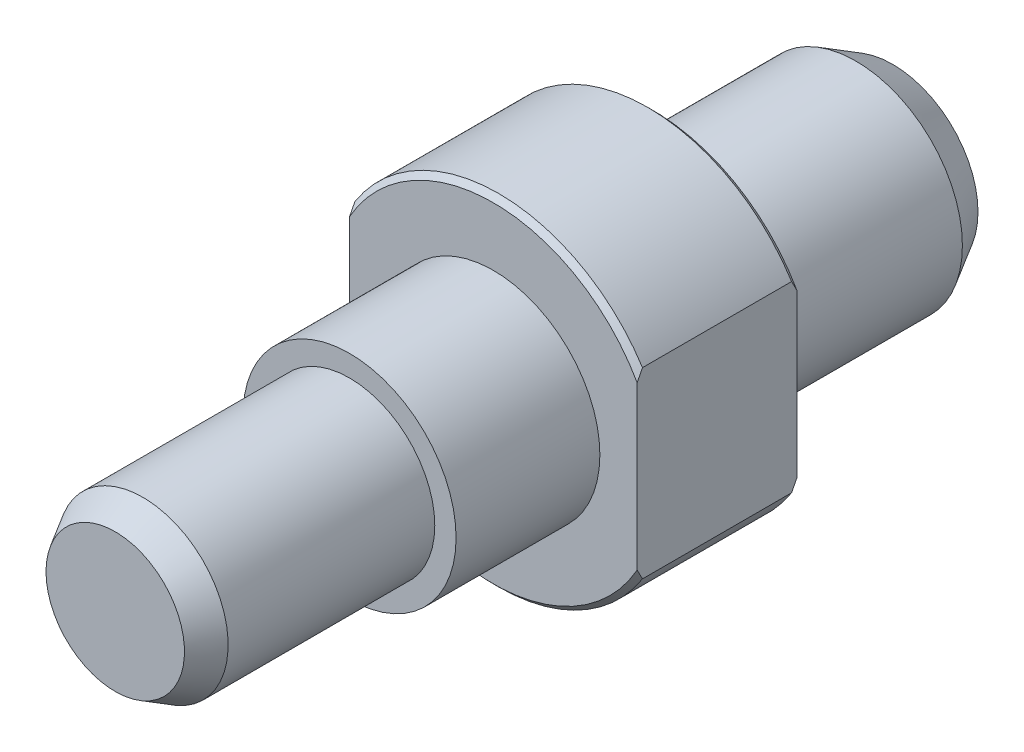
ISO-10303-21;
HEADER;
FILE_DESCRIPTION(('STEP AP214'),'2;1');
FILE_NAME('part.step','',(''),(''),'','','');
FILE_SCHEMA(('AUTOMOTIVE_DESIGN { 1 0 10303 214 1 1 1 1 }'));
ENDSEC;
DATA;
#1=APPLICATION_CONTEXT('core data for automotive mechanical design processes');
#2=APPLICATION_PROTOCOL_DEFINITION('international standard','automotive_design',2000,#1);
#3=PRODUCT_CONTEXT('',#1,'mechanical');
#4=PRODUCT('Part','Part','',(#3));
#5=PRODUCT_RELATED_PRODUCT_CATEGORY('part','',(#4));
#6=PRODUCT_DEFINITION_FORMATION('','',#4);
#7=PRODUCT_DEFINITION_CONTEXT('part definition',#1,'design');
#8=PRODUCT_DEFINITION('design','',#6,#7);
#9=PRODUCT_DEFINITION_SHAPE('','',#8);
#10=(LENGTH_UNIT() NAMED_UNIT(*) SI_UNIT(.MILLI.,.METRE.));
#11=(NAMED_UNIT(*) PLANE_ANGLE_UNIT() SI_UNIT($,.RADIAN.));
#12=(NAMED_UNIT(*) SI_UNIT($,.STERADIAN.) SOLID_ANGLE_UNIT());
#13=UNCERTAINTY_MEASURE_WITH_UNIT(LENGTH_MEASURE(1.E-05),#10,'distance_accuracy_value','');
#14=(GEOMETRIC_REPRESENTATION_CONTEXT(3) GLOBAL_UNCERTAINTY_ASSIGNED_CONTEXT((#13)) GLOBAL_UNIT_ASSIGNED_CONTEXT((#10,
#11,#12)) REPRESENTATION_CONTEXT('',''));
#15=CARTESIAN_POINT('',(0.,0.,0.));
#16=DIRECTION('',(0.,0.,1.));
#17=DIRECTION('',(1.,0.,0.));
#18=AXIS2_PLACEMENT_3D('',#15,#16,#17);
#19=CARTESIAN_POINT('',(0.,0.,0.));
#20=DIRECTION('',(0.,0.,1.));
#21=DIRECTION('',(1.,0.,0.));
#22=AXIS2_PLACEMENT_3D('',#19,#20,#21);
#23=PLANE('',#22);
#24=CARTESIAN_POINT('',(0.,0.,0.));
#25=DIRECTION('',(0.,0.,1.));
#26=DIRECTION('',(1.,0.,0.));
#27=AXIS2_PLACEMENT_3D('',#24,#25,#26);
#28=CIRCLE('',#27,10.);
#29=CARTESIAN_POINT('',(10.,0.,0.));
#30=VERTEX_POINT('',#29);
#31=EDGE_CURVE('E204',#30,#30,#28,.T.);
#32=ORIENTED_EDGE('',*,*,#31,.T.);
#33=EDGE_LOOP('',(#32));
#34=FACE_BOUND('',#33,.T.);
#35=DIRECTION('',(0.,1.,0.));
#36=VECTOR('',#35,1.);
#37=CARTESIAN_POINT('',(13.5,0.,0.));
#38=LINE('',#37,#36);
#39=CARTESIAN_POINT('',(13.5,-7.61577310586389,0.));
#40=VERTEX_POINT('',#39);
#41=CARTESIAN_POINT('',(13.5,7.6157731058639,0.));
#42=VERTEX_POINT('',#41);
#43=EDGE_CURVE('E211',#40,#42,#38,.T.);
#44=ORIENTED_EDGE('',*,*,#43,.F.);
#45=CARTESIAN_POINT('',(0.,0.,0.));
#46=DIRECTION('',(0.,0.,1.));
#47=DIRECTION('',(1.,0.,0.));
#48=AXIS2_PLACEMENT_3D('',#45,#46,#47);
#49=CIRCLE('',#48,15.5);
#50=CARTESIAN_POINT('',(-13.5,-7.6157731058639,0.));
#51=VERTEX_POINT('',#50);
#52=EDGE_CURVE('E401',#40,#51,#49,.F.);
#53=ORIENTED_EDGE('',*,*,#52,.T.);
#54=DIRECTION('',(0.,-1.,0.));
#55=VECTOR('',#54,1.);
#56=CARTESIAN_POINT('',(-13.5,0.,0.));
#57=LINE('',#56,#55);
#58=CARTESIAN_POINT('',(-13.5,7.61577310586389,0.));
#59=VERTEX_POINT('',#58);
#60=EDGE_CURVE('E87',#59,#51,#57,.T.);
#61=ORIENTED_EDGE('',*,*,#60,.F.);
#62=CARTESIAN_POINT('',(0.,0.,0.));
#63=DIRECTION('',(0.,0.,1.));
#64=DIRECTION('',(1.,0.,0.));
#65=AXIS2_PLACEMENT_3D('',#62,#63,#64);
#66=CIRCLE('',#65,15.5);
#67=EDGE_CURVE('E399',#59,#42,#66,.F.);
#68=ORIENTED_EDGE('',*,*,#67,.T.);
#69=EDGE_LOOP('',(#44,#53,#61,#68));
#70=FACE_BOUND('',#69,.T.);
#71=ADVANCED_FACE('F14',(#34,#70),#23,.F.);
#72=CARTESIAN_POINT('',(0.,0.,15.));
#73=DIRECTION('',(0.,0.,-1.));
#74=DIRECTION('',(-1.,0.,0.));
#75=AXIS2_PLACEMENT_3D('',#72,#73,#74);
#76=CYLINDRICAL_SURFACE('',#75,16.);
#77=DIRECTION('',(0.,0.,-1.));
#78=VECTOR('',#77,1.);
#79=CARTESIAN_POINT('',(13.5,8.58778201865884,15.));
#80=LINE('',#79,#78);
#81=CARTESIAN_POINT('',(13.5,8.58778201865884,0.5));
#82=VERTEX_POINT('',#81);
#83=CARTESIAN_POINT('',(13.5,8.58778201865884,14.5));
#84=VERTEX_POINT('',#83);
#85=EDGE_CURVE('E186',#82,#84,#80,.F.);
#86=ORIENTED_EDGE('',*,*,#85,.F.);
#87=CARTESIAN_POINT('',(0.,0.,0.5));
#88=DIRECTION('',(0.,0.,1.));
#89=DIRECTION('',(1.,0.,0.));
#90=AXIS2_PLACEMENT_3D('',#87,#88,#89);
#91=CIRCLE('',#90,16.);
#92=CARTESIAN_POINT('',(-13.5,8.58778201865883,0.5));
#93=VERTEX_POINT('',#92);
#94=EDGE_CURVE('E9',#82,#93,#91,.T.);
#95=ORIENTED_EDGE('',*,*,#94,.T.);
#96=DIRECTION('',(0.,0.,-1.));
#97=VECTOR('',#96,1.);
#98=CARTESIAN_POINT('',(-13.5,8.58778201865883,15.));
#99=LINE('',#98,#97);
#100=CARTESIAN_POINT('',(-13.5,8.58778201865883,14.5));
#101=VERTEX_POINT('',#100);
#102=EDGE_CURVE('E102',#101,#93,#99,.T.);
#103=ORIENTED_EDGE('',*,*,#102,.F.);
#104=CARTESIAN_POINT('',(0.,0.,14.5));
#105=DIRECTION('',(0.,0.,1.));
#106=DIRECTION('',(1.,0.,0.));
#107=AXIS2_PLACEMENT_3D('',#104,#105,#106);
#108=CIRCLE('',#107,16.);
#109=EDGE_CURVE('E23',#101,#84,#108,.F.);
#110=ORIENTED_EDGE('',*,*,#109,.T.);
#111=EDGE_LOOP('',(#86,#95,#103,#110));
#112=FACE_BOUND('',#111,.T.);
#113=ADVANCED_FACE('F185',(#112),#76,.T.);
#114=DIRECTION('',(0.,0.,-1.));
#115=VECTOR('',#114,1.);
#116=CARTESIAN_POINT('',(-13.5,-8.58778201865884,15.));
#117=LINE('',#116,#115);
#118=CARTESIAN_POINT('',(-13.5,-8.58778201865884,0.5));
#119=VERTEX_POINT('',#118);
#120=CARTESIAN_POINT('',(-13.5,-8.58778201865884,14.5));
#121=VERTEX_POINT('',#120);
#122=EDGE_CURVE('E84',#119,#121,#117,.F.);
#123=ORIENTED_EDGE('',*,*,#122,.F.);
#124=CARTESIAN_POINT('',(0.,0.,0.5));
#125=DIRECTION('',(0.,0.,1.));
#126=DIRECTION('',(1.,0.,0.));
#127=AXIS2_PLACEMENT_3D('',#124,#125,#126);
#128=CIRCLE('',#127,16.);
#129=CARTESIAN_POINT('',(13.5,-8.58778201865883,0.5));
#130=VERTEX_POINT('',#129);
#131=EDGE_CURVE('E98',#119,#130,#128,.T.);
#132=ORIENTED_EDGE('',*,*,#131,.T.);
#133=DIRECTION('',(0.,0.,-1.));
#134=VECTOR('',#133,1.);
#135=CARTESIAN_POINT('',(13.5,-8.58778201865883,15.));
#136=LINE('',#135,#134);
#137=CARTESIAN_POINT('',(13.5,-8.58778201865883,14.5));
#138=VERTEX_POINT('',#137);
#139=EDGE_CURVE('E193',#138,#130,#136,.T.);
#140=ORIENTED_EDGE('',*,*,#139,.F.);
#141=CARTESIAN_POINT('',(0.,0.,14.5));
#142=DIRECTION('',(0.,0.,1.));
#143=DIRECTION('',(1.,0.,0.));
#144=AXIS2_PLACEMENT_3D('',#141,#142,#143);
#145=CIRCLE('',#144,16.);
#146=EDGE_CURVE('E101',#138,#121,#145,.F.);
#147=ORIENTED_EDGE('',*,*,#146,.T.);
#148=EDGE_LOOP('',(#123,#132,#140,#147));
#149=FACE_BOUND('',#148,.T.);
#150=ADVANCED_FACE('F96',(#149),#76,.T.);
#151=CARTESIAN_POINT('',(0.,0.,15.));
#152=DIRECTION('',(0.,0.,1.));
#153=DIRECTION('',(1.,0.,0.));
#154=AXIS2_PLACEMENT_3D('',#151,#152,#153);
#155=PLANE('',#154);
#156=CARTESIAN_POINT('',(0.,0.,15.));
#157=DIRECTION('',(0.,0.,1.));
#158=DIRECTION('',(1.,0.,0.));
#159=AXIS2_PLACEMENT_3D('',#156,#157,#158);
#160=CIRCLE('',#159,10.);
#161=CARTESIAN_POINT('',(10.,0.,15.));
#162=VERTEX_POINT('',#161);
#163=EDGE_CURVE('E207',#162,#162,#160,.T.);
#164=ORIENTED_EDGE('',*,*,#163,.F.);
#165=EDGE_LOOP('',(#164));
#166=FACE_BOUND('',#165,.T.);
#167=DIRECTION('',(0.,-1.,0.));
#168=VECTOR('',#167,1.);
#169=CARTESIAN_POINT('',(-13.5,0.,15.));
#170=LINE('',#169,#168);
#171=CARTESIAN_POINT('',(-13.5,7.61577310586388,15.));
#172=VERTEX_POINT('',#171);
#173=CARTESIAN_POINT('',(-13.5,-7.61577310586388,15.));
#174=VERTEX_POINT('',#173);
#175=EDGE_CURVE('E111',#172,#174,#170,.T.);
#176=ORIENTED_EDGE('',*,*,#175,.T.);
#177=CARTESIAN_POINT('',(0.,0.,15.));
#178=DIRECTION('',(0.,0.,1.));
#179=DIRECTION('',(1.,0.,0.));
#180=AXIS2_PLACEMENT_3D('',#177,#178,#179);
#181=CIRCLE('',#180,15.5);
#182=CARTESIAN_POINT('',(13.5,-7.61577310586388,15.));
#183=VERTEX_POINT('',#182);
#184=EDGE_CURVE('E179',#174,#183,#181,.T.);
#185=ORIENTED_EDGE('',*,*,#184,.T.);
#186=DIRECTION('',(0.,1.,0.));
#187=VECTOR('',#186,1.);
#188=CARTESIAN_POINT('',(13.5,0.,15.));
#189=LINE('',#188,#187);
#190=CARTESIAN_POINT('',(13.5,7.61577310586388,15.));
#191=VERTEX_POINT('',#190);
#192=EDGE_CURVE('E200',#183,#191,#189,.T.);
#193=ORIENTED_EDGE('',*,*,#192,.T.);
#194=CARTESIAN_POINT('',(0.,0.,15.));
#195=DIRECTION('',(0.,0.,1.));
#196=DIRECTION('',(1.,0.,0.));
#197=AXIS2_PLACEMENT_3D('',#194,#195,#196);
#198=CIRCLE('',#197,15.5);
#199=EDGE_CURVE('E91',#191,#172,#198,.T.);
#200=ORIENTED_EDGE('',*,*,#199,.T.);
#201=EDGE_LOOP('',(#176,#185,#193,#200));
#202=FACE_BOUND('',#201,.T.);
#203=ADVANCED_FACE('F198',(#166,#202),#155,.T.);
#204=CARTESIAN_POINT('',(0.,0.,0.));
#205=DIRECTION('',(0.,0.,-1.));
#206=DIRECTION('',(-1.,0.,0.));
#207=AXIS2_PLACEMENT_3D('',#204,#205,#206);
#208=CYLINDRICAL_SURFACE('',#207,10.);
#209=CARTESIAN_POINT('',(0.,0.,-19.0358983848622));
#210=DIRECTION('',(0.,0.,1.));
#211=DIRECTION('',(1.,0.,0.));
#212=AXIS2_PLACEMENT_3D('',#209,#210,#211);
#213=CIRCLE('',#212,10.);
#214=CARTESIAN_POINT('',(10.,0.,-19.0358983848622));
#215=VERTEX_POINT('',#214);
#216=EDGE_CURVE('E103',#215,#215,#213,.T.);
#217=ORIENTED_EDGE('',*,*,#216,.T.);
#218=EDGE_LOOP('',(#217));
#219=FACE_BOUND('',#218,.T.);
#220=ORIENTED_EDGE('',*,*,#31,.F.);
#221=EDGE_LOOP('',(#220));
#222=FACE_BOUND('',#221,.T.);
#223=ADVANCED_FACE('F257',(#219,#222),#208,.T.);
#224=CARTESIAN_POINT('',(0.,0.,28.5));
#225=DIRECTION('',(0.,0.,-1.));
#226=DIRECTION('',(-1.,0.,0.));
#227=AXIS2_PLACEMENT_3D('',#224,#225,#226);
#228=CYLINDRICAL_SURFACE('',#227,10.);
#229=CARTESIAN_POINT('',(0.,0.,28.5));
#230=DIRECTION('',(0.,0.,1.));
#231=DIRECTION('',(1.,0.,0.));
#232=AXIS2_PLACEMENT_3D('',#229,#230,#231);
#233=CIRCLE('',#232,10.);
#234=CARTESIAN_POINT('',(10.,0.,28.5));
#235=VERTEX_POINT('',#234);
#236=EDGE_CURVE('E208',#235,#235,#233,.T.);
#237=ORIENTED_EDGE('',*,*,#236,.F.);
#238=EDGE_LOOP('',(#237));
#239=FACE_BOUND('',#238,.T.);
#240=ORIENTED_EDGE('',*,*,#163,.T.);
#241=EDGE_LOOP('',(#240));
#242=FACE_BOUND('',#241,.T.);
#243=ADVANCED_FACE('F254',(#239,#242),#228,.T.);
#244=CARTESIAN_POINT('',(0.,0.,28.5));
#245=DIRECTION('',(0.,0.,1.));
#246=DIRECTION('',(1.,0.,0.));
#247=AXIS2_PLACEMENT_3D('',#244,#245,#246);
#248=PLANE('',#247);
#249=CARTESIAN_POINT('',(0.,0.,28.5));
#250=DIRECTION('',(0.,0.,1.));
#251=DIRECTION('',(1.,0.,0.));
#252=AXIS2_PLACEMENT_3D('',#249,#250,#251);
#253=CIRCLE('',#252,8.);
#254=CARTESIAN_POINT('',(8.,0.,28.5));
#255=VERTEX_POINT('',#254);
#256=EDGE_CURVE('E201',#255,#255,#253,.T.);
#257=ORIENTED_EDGE('',*,*,#256,.F.);
#258=EDGE_LOOP('',(#257));
#259=FACE_BOUND('',#258,.T.);
#260=ORIENTED_EDGE('',*,*,#236,.T.);
#261=EDGE_LOOP('',(#260));
#262=FACE_BOUND('',#261,.T.);
#263=ADVANCED_FACE('F265',(#259,#262),#248,.T.);
#264=CARTESIAN_POINT('',(0.,0.,50.5));
#265=DIRECTION('',(0.,0.,-1.));
#266=DIRECTION('',(-1.,0.,0.));
#267=AXIS2_PLACEMENT_3D('',#264,#265,#266);
#268=CYLINDRICAL_SURFACE('',#267,8.);
#269=CARTESIAN_POINT('',(0.,0.,47.9019237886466));
#270=DIRECTION('',(0.,0.,-1.));
#271=DIRECTION('',(-1.,0.,0.));
#272=AXIS2_PLACEMENT_3D('',#269,#270,#271);
#273=CIRCLE('',#272,8.);
#274=CARTESIAN_POINT('',(-8.,0.,47.9019237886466));
#275=VERTEX_POINT('',#274);
#276=EDGE_CURVE('E225',#275,#275,#273,.T.);
#277=ORIENTED_EDGE('',*,*,#276,.T.);
#278=EDGE_LOOP('',(#277));
#279=FACE_BOUND('',#278,.T.);
#280=ORIENTED_EDGE('',*,*,#256,.T.);
#281=EDGE_LOOP('',(#280));
#282=FACE_BOUND('',#281,.T.);
#283=ADVANCED_FACE('F130',(#279,#282),#268,.T.);
#284=CARTESIAN_POINT('',(13.5,16.5671544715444,50.5));
#285=DIRECTION('',(1.,0.,0.));
#286=DIRECTION('',(0.,1.,0.));
#287=AXIS2_PLACEMENT_3D('',#284,#285,#286);
#288=PLANE('',#287);
#289=ORIENTED_EDGE('',*,*,#139,.T.);
#290=CARTESIAN_POINT('',(13.5,-8.58778201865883,0.5));
#291=CARTESIAN_POINT('',(13.5,-8.50751562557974,0.456918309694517));
#292=CARTESIAN_POINT('',(13.5,-8.42706999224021,0.414170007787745));
#293=CARTESIAN_POINT('',(13.5,-8.26581899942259,0.3293733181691));
#294=CARTESIAN_POINT('',(13.5,-8.18501366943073,0.287324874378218));
#295=CARTESIAN_POINT('',(13.5,-8.0230287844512,0.203953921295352));
#296=CARTESIAN_POINT('',(13.5,-7.94184922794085,0.162631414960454));
#297=CARTESIAN_POINT('',(13.5,-7.77910228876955,0.0807409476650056));
#298=CARTESIAN_POINT('',(13.5,-7.69753487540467,0.0401730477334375));
#299=CARTESIAN_POINT('',(13.5,-7.6157731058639,0.));
#300=B_SPLINE_CURVE_WITH_KNOTS('',3,(#290,#291,#292,#293,#294,#295,#296,#297,#298,#299),
.UNSPECIFIED.,.F.,.F.,(4,2,2,2,4),(0.,0.273291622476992,0.546561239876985,0.81983197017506,
1.09312470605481),.UNSPECIFIED.);
#301=EDGE_CURVE('E106',#130,#40,#300,.T.);
#302=ORIENTED_EDGE('',*,*,#301,.T.);
#303=ORIENTED_EDGE('',*,*,#43,.T.);
#304=CARTESIAN_POINT('',(13.5,7.6157731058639,0.));
#305=CARTESIAN_POINT('',(13.5,7.69753487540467,0.0401730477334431));
#306=CARTESIAN_POINT('',(13.5,7.77910228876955,0.0807409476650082));
#307=CARTESIAN_POINT('',(13.5,7.94184922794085,0.162631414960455));
#308=CARTESIAN_POINT('',(13.5,8.02302878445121,0.203953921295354));
#309=CARTESIAN_POINT('',(13.5,8.18501366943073,0.28732487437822));
#310=CARTESIAN_POINT('',(13.5,8.26581899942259,0.329373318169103));
#311=CARTESIAN_POINT('',(13.5,8.42706999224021,0.414170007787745));
#312=CARTESIAN_POINT('',(13.5,8.50751562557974,0.456918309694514));
#313=CARTESIAN_POINT('',(13.5,8.58778201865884,0.49999999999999));
#314=B_SPLINE_CURVE_WITH_KNOTS('',3,(#304,#305,#306,#307,#308,#309,#310,#311,#312,#313),
.UNSPECIFIED.,.F.,.F.,(4,2,2,2,4),(0.,0.273292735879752,0.546563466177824,0.819833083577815,
1.09312470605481),.UNSPECIFIED.);
#315=EDGE_CURVE('E109',#42,#82,#314,.T.);
#316=ORIENTED_EDGE('',*,*,#315,.T.);
#317=ORIENTED_EDGE('',*,*,#85,.T.);
#318=CARTESIAN_POINT('',(13.5,8.58778201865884,14.5));
#319=CARTESIAN_POINT('',(13.5,8.50751562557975,14.5430816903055));
#320=CARTESIAN_POINT('',(13.5,8.42706999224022,14.5858299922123));
#321=CARTESIAN_POINT('',(13.5,8.2658189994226,14.6706266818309));
#322=CARTESIAN_POINT('',(13.5,8.18501366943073,14.7126751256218));
#323=CARTESIAN_POINT('',(13.5,8.02302878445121,14.7960460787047));
#324=CARTESIAN_POINT('',(13.5,7.94184922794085,14.8373685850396));
#325=CARTESIAN_POINT('',(13.5,7.77910228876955,14.919259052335));
#326=CARTESIAN_POINT('',(13.5,7.69753487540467,14.9598269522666));
#327=CARTESIAN_POINT('',(13.5,7.61577310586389,15.));
#328=B_SPLINE_CURVE_WITH_KNOTS('',3,(#318,#319,#320,#321,#322,#323,#324,#325,#326,#327),
.UNSPECIFIED.,.F.,.F.,(4,2,2,2,4),(0.,0.273291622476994,0.54656123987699,0.819831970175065,
1.09312470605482),.UNSPECIFIED.);
#329=EDGE_CURVE('E107',#84,#191,#328,.T.);
#330=ORIENTED_EDGE('',*,*,#329,.T.);
#331=ORIENTED_EDGE('',*,*,#192,.F.);
#332=CARTESIAN_POINT('',(13.5,-7.61577310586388,15.));
#333=CARTESIAN_POINT('',(13.5,-7.69753487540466,14.9598269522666));
#334=CARTESIAN_POINT('',(13.5,-7.77910228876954,14.919259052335));
#335=CARTESIAN_POINT('',(13.5,-7.94184922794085,14.8373685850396));
#336=CARTESIAN_POINT('',(13.5,-8.02302878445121,14.7960460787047));
#337=CARTESIAN_POINT('',(13.5,-8.18501366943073,14.7126751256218));
#338=CARTESIAN_POINT('',(13.5,-8.2658189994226,14.6706266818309));
#339=CARTESIAN_POINT('',(13.5,-8.42706999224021,14.5858299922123));
#340=CARTESIAN_POINT('',(13.5,-8.50751562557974,14.5430816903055));
#341=CARTESIAN_POINT('',(13.5,-8.58778201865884,14.5));
#342=B_SPLINE_CURVE_WITH_KNOTS('',3,(#332,#333,#334,#335,#336,#337,#338,#339,#340,#341),
.UNSPECIFIED.,.F.,.F.,(4,2,2,2,4),(0.,0.273292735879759,0.546563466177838,0.819833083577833,
1.09312470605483),.UNSPECIFIED.);
#343=EDGE_CURVE('E140',#183,#138,#342,.T.);
#344=ORIENTED_EDGE('',*,*,#343,.T.);
#345=EDGE_LOOP('',(#289,#302,#303,#316,#317,#330,#331,#344));
#346=FACE_BOUND('',#345,.T.);
#347=ADVANCED_FACE('F125',(#346),#288,.T.);
#348=CARTESIAN_POINT('',(-13.5,16.5671544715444,50.5));
#349=DIRECTION('',(-1.,0.,0.));
#350=DIRECTION('',(0.,-1.,0.));
#351=AXIS2_PLACEMENT_3D('',#348,#349,#350);
#352=PLANE('',#351);
#353=ORIENTED_EDGE('',*,*,#60,.T.);
#354=CARTESIAN_POINT('',(-13.5,-7.6157731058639,0.));
#355=CARTESIAN_POINT('',(-13.5,-7.69753487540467,0.0401730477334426));
#356=CARTESIAN_POINT('',(-13.5,-7.77910228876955,0.0807409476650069));
#357=CARTESIAN_POINT('',(-13.5,-7.94184922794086,0.162631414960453));
#358=CARTESIAN_POINT('',(-13.5,-8.02302878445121,0.203953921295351));
#359=CARTESIAN_POINT('',(-13.5,-8.18501366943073,0.287324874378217));
#360=CARTESIAN_POINT('',(-13.5,-8.2658189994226,0.329373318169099));
#361=CARTESIAN_POINT('',(-13.5,-8.42706999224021,0.414170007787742));
#362=CARTESIAN_POINT('',(-13.5,-8.50751562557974,0.456918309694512));
#363=CARTESIAN_POINT('',(-13.5,-8.58778201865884,0.49999999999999));
#364=B_SPLINE_CURVE_WITH_KNOTS('',3,(#354,#355,#356,#357,#358,#359,#360,#361,#362,#363),
.UNSPECIFIED.,.F.,.F.,(4,2,2,2,4),(0.,0.273292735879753,0.546563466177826,0.819833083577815,
1.09312470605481),.UNSPECIFIED.);
#365=EDGE_CURVE('E81',#51,#119,#364,.T.);
#366=ORIENTED_EDGE('',*,*,#365,.T.);
#367=ORIENTED_EDGE('',*,*,#122,.T.);
#368=CARTESIAN_POINT('',(-13.5,-8.58778201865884,14.5));
#369=CARTESIAN_POINT('',(-13.5,-8.50751562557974,14.5430816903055));
#370=CARTESIAN_POINT('',(-13.5,-8.42706999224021,14.5858299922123));
#371=CARTESIAN_POINT('',(-13.5,-8.2658189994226,14.6706266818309));
#372=CARTESIAN_POINT('',(-13.5,-8.18501366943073,14.7126751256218));
#373=CARTESIAN_POINT('',(-13.5,-8.02302878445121,14.7960460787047));
#374=CARTESIAN_POINT('',(-13.5,-7.94184922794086,14.8373685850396));
#375=CARTESIAN_POINT('',(-13.5,-7.77910228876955,14.919259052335));
#376=CARTESIAN_POINT('',(-13.5,-7.69753487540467,14.9598269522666));
#377=CARTESIAN_POINT('',(-13.5,-7.61577310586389,15.));
#378=B_SPLINE_CURVE_WITH_KNOTS('',3,(#368,#369,#370,#371,#372,#373,#374,#375,#376,#377),
.UNSPECIFIED.,.F.,.F.,(4,2,2,2,4),(0.,0.273291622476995,0.54656123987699,0.819831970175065,
1.09312470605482),.UNSPECIFIED.);
#379=EDGE_CURVE('E92',#121,#174,#378,.T.);
#380=ORIENTED_EDGE('',*,*,#379,.T.);
#381=ORIENTED_EDGE('',*,*,#175,.F.);
#382=CARTESIAN_POINT('',(-13.5,7.61577310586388,15.));
#383=CARTESIAN_POINT('',(-13.5,7.69753487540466,14.9598269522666));
#384=CARTESIAN_POINT('',(-13.5,7.77910228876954,14.919259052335));
#385=CARTESIAN_POINT('',(-13.5,7.94184922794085,14.8373685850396));
#386=CARTESIAN_POINT('',(-13.5,8.02302878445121,14.7960460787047));
#387=CARTESIAN_POINT('',(-13.5,8.18501366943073,14.7126751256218));
#388=CARTESIAN_POINT('',(-13.5,8.2658189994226,14.6706266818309));
#389=CARTESIAN_POINT('',(-13.5,8.42706999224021,14.5858299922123));
#390=CARTESIAN_POINT('',(-13.5,8.50751562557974,14.5430816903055));
#391=CARTESIAN_POINT('',(-13.5,8.58778201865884,14.5));
#392=B_SPLINE_CURVE_WITH_KNOTS('',3,(#382,#383,#384,#385,#386,#387,#388,#389,#390,#391),
.UNSPECIFIED.,.F.,.F.,(4,2,2,2,4),(0.,0.273292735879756,0.546563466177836,0.819833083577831,
1.09312470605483),.UNSPECIFIED.);
#393=EDGE_CURVE('E37',#172,#101,#392,.T.);
#394=ORIENTED_EDGE('',*,*,#393,.T.);
#395=ORIENTED_EDGE('',*,*,#102,.T.);
#396=CARTESIAN_POINT('',(-13.5,8.58778201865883,0.5));
#397=CARTESIAN_POINT('',(-13.5,8.50751562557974,0.456918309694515));
#398=CARTESIAN_POINT('',(-13.5,8.42706999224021,0.414170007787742));
#399=CARTESIAN_POINT('',(-13.5,8.2658189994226,0.329373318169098));
#400=CARTESIAN_POINT('',(-13.5,8.18501366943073,0.287324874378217));
#401=CARTESIAN_POINT('',(-13.5,8.02302878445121,0.203953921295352));
#402=CARTESIAN_POINT('',(-13.5,7.94184922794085,0.162631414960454));
#403=CARTESIAN_POINT('',(-13.5,7.77910228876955,0.0807409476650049));
#404=CARTESIAN_POINT('',(-13.5,7.69753487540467,0.0401730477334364));
#405=CARTESIAN_POINT('',(-13.5,7.6157731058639,0.));
#406=B_SPLINE_CURVE_WITH_KNOTS('',3,(#396,#397,#398,#399,#400,#401,#402,#403,#404,#405),
.UNSPECIFIED.,.F.,.F.,(4,2,2,2,4),(0.,0.273291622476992,0.546561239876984,0.819831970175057,
1.09312470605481),.UNSPECIFIED.);
#407=EDGE_CURVE('E30',#93,#59,#406,.T.);
#408=ORIENTED_EDGE('',*,*,#407,.T.);
#409=EDGE_LOOP('',(#353,#366,#367,#380,#381,#394,#395,#408));
#410=FACE_BOUND('',#409,.T.);
#411=ADVANCED_FACE('F83',(#410),#352,.T.);
#412=CARTESIAN_POINT('',(0.,0.,0.5));
#413=DIRECTION('',(0.,0.,1.));
#414=DIRECTION('',(1.,0.,0.));
#415=AXIS2_PLACEMENT_3D('',#412,#413,#414);
#416=CONICAL_SURFACE('',#415,16.,0.785398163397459);
#417=ORIENTED_EDGE('',*,*,#365,.F.);
#418=ORIENTED_EDGE('',*,*,#52,.F.);
#419=ORIENTED_EDGE('',*,*,#301,.F.);
#420=ORIENTED_EDGE('',*,*,#131,.F.);
#421=EDGE_LOOP('',(#417,#418,#419,#420));
#422=FACE_BOUND('',#421,.T.);
#423=ADVANCED_FACE('F105',(#422),#416,.T.);
#424=CARTESIAN_POINT('',(0.,0.,15.));
#425=DIRECTION('',(0.,0.,-1.));
#426=DIRECTION('',(-1.,0.,0.));
#427=AXIS2_PLACEMENT_3D('',#424,#425,#426);
#428=CONICAL_SURFACE('',#427,15.5,0.785398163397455);
#429=ORIENTED_EDGE('',*,*,#379,.F.);
#430=ORIENTED_EDGE('',*,*,#146,.F.);
#431=ORIENTED_EDGE('',*,*,#343,.F.);
#432=ORIENTED_EDGE('',*,*,#184,.F.);
#433=EDGE_LOOP('',(#429,#430,#431,#432));
#434=FACE_BOUND('',#433,.T.);
#435=ADVANCED_FACE('F152',(#434),#428,.T.);
#436=CARTESIAN_POINT('',(0.,0.,0.5));
#437=DIRECTION('',(0.,0.,1.));
#438=DIRECTION('',(1.,0.,0.));
#439=AXIS2_PLACEMENT_3D('',#436,#437,#438);
#440=CONICAL_SURFACE('',#439,16.,0.785398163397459);
#441=ORIENTED_EDGE('',*,*,#315,.F.);
#442=ORIENTED_EDGE('',*,*,#67,.F.);
#443=ORIENTED_EDGE('',*,*,#407,.F.);
#444=ORIENTED_EDGE('',*,*,#94,.F.);
#445=EDGE_LOOP('',(#441,#442,#443,#444));
#446=FACE_BOUND('',#445,.T.);
#447=ADVANCED_FACE('F155',(#446),#440,.T.);
#448=CARTESIAN_POINT('',(0.,0.,15.));
#449=DIRECTION('',(0.,0.,-1.));
#450=DIRECTION('',(-1.,0.,0.));
#451=AXIS2_PLACEMENT_3D('',#448,#449,#450);
#452=CONICAL_SURFACE('',#451,15.5,0.785398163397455);
#453=ORIENTED_EDGE('',*,*,#329,.F.);
#454=ORIENTED_EDGE('',*,*,#109,.F.);
#455=ORIENTED_EDGE('',*,*,#393,.F.);
#456=ORIENTED_EDGE('',*,*,#199,.F.);
#457=EDGE_LOOP('',(#453,#454,#455,#456));
#458=FACE_BOUND('',#457,.T.);
#459=ADVANCED_FACE('F16',(#458),#452,.T.);
#460=CARTESIAN_POINT('',(0.,0.,-13.3355381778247));
#461=DIRECTION('',(0.,0.,1.));
#462=DIRECTION('',(1.,0.,0.));
#463=AXIS2_PLACEMENT_3D('',#460,#461,#462);
#464=CONICAL_SURFACE('',#463,13.2911045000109,0.523598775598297);
#465=CARTESIAN_POINT('',(0.,0.,-22.5));
#466=DIRECTION('',(0.,0.,-1.));
#467=DIRECTION('',(-1.,0.,0.));
#468=AXIS2_PLACEMENT_3D('',#465,#466,#467);
#469=CIRCLE('',#468,8.);
#470=CARTESIAN_POINT('',(-8.,0.,-22.5));
#471=VERTEX_POINT('',#470);
#472=EDGE_CURVE('E222',#471,#471,#469,.T.);
#473=ORIENTED_EDGE('',*,*,#472,.F.);
#474=EDGE_LOOP('',(#473));
#475=FACE_BOUND('',#474,.T.);
#476=ORIENTED_EDGE('',*,*,#216,.F.);
#477=EDGE_LOOP('',(#476));
#478=FACE_BOUND('',#477,.T.);
#479=ADVANCED_FACE('F261',(#475,#478),#464,.T.);
#480=CARTESIAN_POINT('',(0.,0.,-22.5));
#481=DIRECTION('',(0.,0.,1.));
#482=DIRECTION('',(1.,0.,0.));
#483=AXIS2_PLACEMENT_3D('',#480,#481,#482);
#484=PLANE('',#483);
#485=ORIENTED_EDGE('',*,*,#472,.T.);
#486=EDGE_LOOP('',(#485));
#487=FACE_BOUND('',#486,.T.);
#488=ADVANCED_FACE('F241',(#487),#484,.F.);
#489=CARTESIAN_POINT('',(0.,0.,50.5));
#490=DIRECTION('',(0.,0.,-1.));
#491=DIRECTION('',(-1.,0.,0.));
#492=AXIS2_PLACEMENT_3D('',#489,#490,#491);
#493=CONICAL_SURFACE('',#492,6.5,0.523598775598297);
#494=CARTESIAN_POINT('',(0.,0.,50.5));
#495=DIRECTION('',(0.,0.,-1.));
#496=DIRECTION('',(-1.,0.,0.));
#497=AXIS2_PLACEMENT_3D('',#494,#495,#496);
#498=CIRCLE('',#497,6.5);
#499=CARTESIAN_POINT('',(-6.5,0.,50.5));
#500=VERTEX_POINT('',#499);
#501=EDGE_CURVE('E228',#500,#500,#498,.T.);
#502=ORIENTED_EDGE('',*,*,#501,.T.);
#503=EDGE_LOOP('',(#502));
#504=FACE_BOUND('',#503,.T.);
#505=ORIENTED_EDGE('',*,*,#276,.F.);
#506=EDGE_LOOP('',(#505));
#507=FACE_BOUND('',#506,.T.);
#508=ADVANCED_FACE('F232',(#504,#507),#493,.T.);
#509=CARTESIAN_POINT('',(0.,0.,50.5));
#510=DIRECTION('',(0.,0.,1.));
#511=DIRECTION('',(1.,0.,0.));
#512=AXIS2_PLACEMENT_3D('',#509,#510,#511);
#513=PLANE('',#512);
#514=ORIENTED_EDGE('',*,*,#501,.F.);
#515=EDGE_LOOP('',(#514));
#516=FACE_BOUND('',#515,.T.);
#517=ADVANCED_FACE('F134',(#516),#513,.T.);
#518=CLOSED_SHELL('',(#71,#113,#150,#203,#223,#243,#263,#283,#347,#411,#423,#435,#447,#459,#479,
#488,#508,#517));
#519=MANIFOLD_SOLID_BREP('B1',#518);
#520=ADVANCED_BREP_SHAPE_REPRESENTATION('',(#18,#519),#14);
#521=SHAPE_DEFINITION_REPRESENTATION(#9,#520);
ENDSEC;
END-ISO-10303-21;
